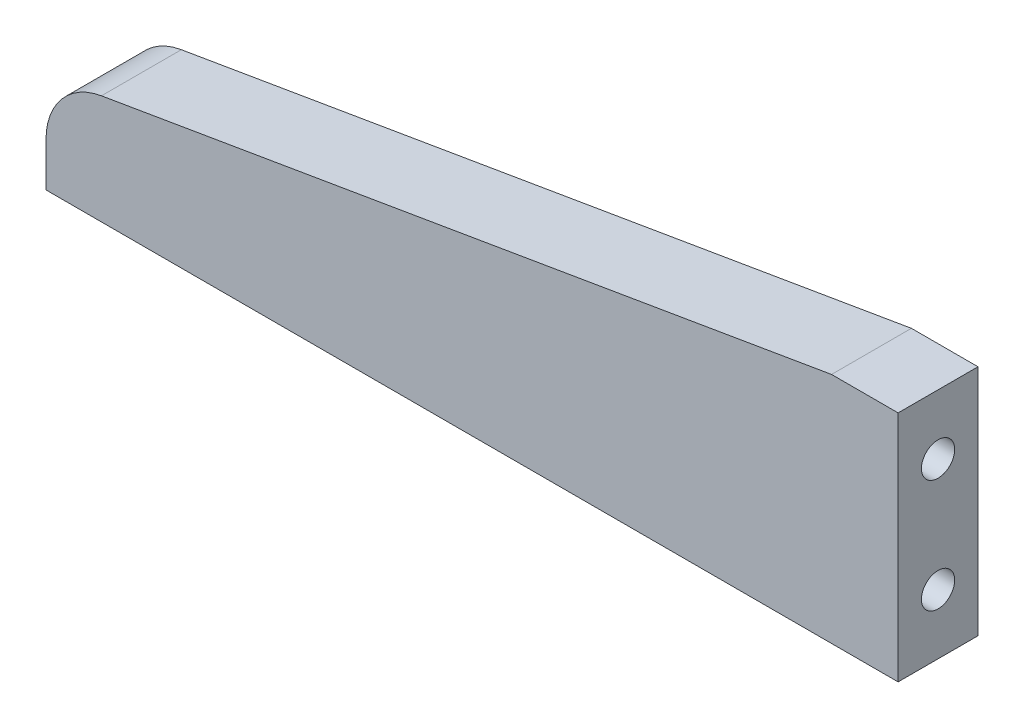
ISO-10303-21;
HEADER;
FILE_DESCRIPTION(('STEP AP214'),'2;1');
FILE_NAME('part.step','',(''),(''),'','','');
FILE_SCHEMA(('AUTOMOTIVE_DESIGN { 1 0 10303 214 1 1 1 1 }'));
ENDSEC;
DATA;
#1=APPLICATION_CONTEXT('core data for automotive mechanical design processes');
#2=APPLICATION_PROTOCOL_DEFINITION('international standard','automotive_design',2000,#1);
#3=PRODUCT_CONTEXT('',#1,'mechanical');
#4=PRODUCT('Part','Part','',(#3));
#5=PRODUCT_RELATED_PRODUCT_CATEGORY('part','',(#4));
#6=PRODUCT_DEFINITION_FORMATION('','',#4);
#7=PRODUCT_DEFINITION_CONTEXT('part definition',#1,'design');
#8=PRODUCT_DEFINITION('design','',#6,#7);
#9=PRODUCT_DEFINITION_SHAPE('','',#8);
#10=(LENGTH_UNIT() NAMED_UNIT(*) SI_UNIT(.MILLI.,.METRE.));
#11=(NAMED_UNIT(*) PLANE_ANGLE_UNIT() SI_UNIT($,.RADIAN.));
#12=(NAMED_UNIT(*) SI_UNIT($,.STERADIAN.) SOLID_ANGLE_UNIT());
#13=UNCERTAINTY_MEASURE_WITH_UNIT(LENGTH_MEASURE(1.E-05),#10,'distance_accuracy_value','');
#14=(GEOMETRIC_REPRESENTATION_CONTEXT(3) GLOBAL_UNCERTAINTY_ASSIGNED_CONTEXT((#13)) GLOBAL_UNIT_ASSIGNED_CONTEXT((#10,
#11,#12)) REPRESENTATION_CONTEXT('',''));
#15=CARTESIAN_POINT('',(0.,0.,0.));
#16=DIRECTION('',(0.,0.,1.));
#17=DIRECTION('',(1.,0.,0.));
#18=AXIS2_PLACEMENT_3D('',#15,#16,#17);
#19=CARTESIAN_POINT('',(-12.,-8.,12.));
#20=DIRECTION('',(-1.,0.,0.));
#21=DIRECTION('',(0.,0.,1.));
#22=AXIS2_PLACEMENT_3D('',#19,#20,#21);
#23=PLANE('',#22);
#24=CARTESIAN_POINT('',(-12.,1.,6.));
#25=DIRECTION('',(1.,0.,0.));
#26=DIRECTION('',(0.,0.,-1.));
#27=AXIS2_PLACEMENT_3D('',#24,#25,#26);
#28=CIRCLE('',#27,2.5);
#29=CARTESIAN_POINT('',(-12.,1.,3.5));
#30=VERTEX_POINT('',#29);
#31=EDGE_CURVE('E100',#30,#30,#28,.T.);
#32=ORIENTED_EDGE('',*,*,#31,.F.);
#33=EDGE_LOOP('',(#32));
#34=FACE_BOUND('',#33,.T.);
#35=CARTESIAN_POINT('',(-12.,18.,6.));
#36=DIRECTION('',(1.,0.,0.));
#37=DIRECTION('',(0.,0.,-1.));
#38=AXIS2_PLACEMENT_3D('',#35,#36,#37);
#39=CIRCLE('',#38,2.5);
#40=CARTESIAN_POINT('',(-12.,18.,3.5));
#41=VERTEX_POINT('',#40);
#42=EDGE_CURVE('E106',#41,#41,#39,.T.);
#43=ORIENTED_EDGE('',*,*,#42,.F.);
#44=EDGE_LOOP('',(#43));
#45=FACE_BOUND('',#44,.T.);
#46=DIRECTION('',(0.,1.,0.));
#47=VECTOR('',#46,1.);
#48=CARTESIAN_POINT('',(-12.,-8.,0.));
#49=LINE('',#48,#47);
#50=CARTESIAN_POINT('',(-12.,-8.,0.));
#51=VERTEX_POINT('',#50);
#52=CARTESIAN_POINT('',(-12.,27.,0.));
#53=VERTEX_POINT('',#52);
#54=EDGE_CURVE('E112',#51,#53,#49,.T.);
#55=ORIENTED_EDGE('',*,*,#54,.T.);
#56=DIRECTION('',(0.,0.,-1.));
#57=VECTOR('',#56,1.);
#58=CARTESIAN_POINT('',(-12.,27.,12.));
#59=LINE('',#58,#57);
#60=CARTESIAN_POINT('',(-12.,27.,12.));
#61=VERTEX_POINT('',#60);
#62=EDGE_CURVE('E143',#61,#53,#59,.T.);
#63=ORIENTED_EDGE('',*,*,#62,.F.);
#64=DIRECTION('',(0.,1.,0.));
#65=VECTOR('',#64,1.);
#66=CARTESIAN_POINT('',(-12.,-8.,12.));
#67=LINE('',#66,#65);
#68=CARTESIAN_POINT('',(-12.,-8.,12.));
#69=VERTEX_POINT('',#68);
#70=EDGE_CURVE('E113',#69,#61,#67,.T.);
#71=ORIENTED_EDGE('',*,*,#70,.F.);
#72=DIRECTION('',(0.,0.,-1.));
#73=VECTOR('',#72,1.);
#74=CARTESIAN_POINT('',(-12.,-8.,12.));
#75=LINE('',#74,#73);
#76=EDGE_CURVE('E125',#69,#51,#75,.T.);
#77=ORIENTED_EDGE('',*,*,#76,.T.);
#78=EDGE_LOOP('',(#55,#63,#71,#77));
#79=FACE_BOUND('',#78,.T.);
#80=ADVANCED_FACE('F16',(#34,#45,#79),#23,.F.);
#81=CARTESIAN_POINT('',(-12.,27.,12.));
#82=DIRECTION('',(0.,-1.,0.));
#83=DIRECTION('',(1.,0.,0.));
#84=AXIS2_PLACEMENT_3D('',#81,#82,#83);
#85=PLANE('',#84);
#86=DIRECTION('',(-1.,0.,0.));
#87=VECTOR('',#86,1.);
#88=CARTESIAN_POINT('',(-12.,27.,0.));
#89=LINE('',#88,#87);
#90=CARTESIAN_POINT('',(-22.,27.,0.));
#91=VERTEX_POINT('',#90);
#92=EDGE_CURVE('E128',#53,#91,#89,.T.);
#93=ORIENTED_EDGE('',*,*,#92,.T.);
#94=DIRECTION('',(0.,0.,-1.));
#95=VECTOR('',#94,1.);
#96=CARTESIAN_POINT('',(-22.,27.,12.));
#97=LINE('',#96,#95);
#98=CARTESIAN_POINT('',(-22.,27.,12.));
#99=VERTEX_POINT('',#98);
#100=EDGE_CURVE('E140',#99,#91,#97,.T.);
#101=ORIENTED_EDGE('',*,*,#100,.F.);
#102=DIRECTION('',(-1.,0.,0.));
#103=VECTOR('',#102,1.);
#104=CARTESIAN_POINT('',(-12.,27.,12.));
#105=LINE('',#104,#103);
#106=EDGE_CURVE('E116',#61,#99,#105,.T.);
#107=ORIENTED_EDGE('',*,*,#106,.F.);
#108=ORIENTED_EDGE('',*,*,#62,.T.);
#109=EDGE_LOOP('',(#93,#101,#107,#108));
#110=FACE_BOUND('',#109,.T.);
#111=ADVANCED_FACE('F182',(#110),#85,.F.);
#112=CARTESIAN_POINT('',(-140.,7.,12.));
#113=DIRECTION('',(0.167108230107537,-0.985938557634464,0.));
#114=DIRECTION('',(0.985938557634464,0.167108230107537,0.));
#115=AXIS2_PLACEMENT_3D('',#112,#113,#114);
#116=PLANE('',#115);
#117=DIRECTION('',(-0.985938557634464,-0.167108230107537,0.));
#118=VECTOR('',#117,1.);
#119=CARTESIAN_POINT('',(-140.,7.,0.));
#120=LINE('',#119,#118);
#121=CARTESIAN_POINT('',(-131.671082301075,8.41168096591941,0.));
#122=VERTEX_POINT('',#121);
#123=EDGE_CURVE('E130',#91,#122,#120,.T.);
#124=ORIENTED_EDGE('',*,*,#123,.T.);
#125=DIRECTION('',(0.,0.,-1.));
#126=VECTOR('',#125,1.);
#127=CARTESIAN_POINT('',(-131.671082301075,8.41168096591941,12.));
#128=LINE('',#127,#126);
#129=CARTESIAN_POINT('',(-131.671082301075,8.41168096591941,12.));
#130=VERTEX_POINT('',#129);
#131=EDGE_CURVE('E24',#122,#130,#128,.F.);
#132=ORIENTED_EDGE('',*,*,#131,.T.);
#133=DIRECTION('',(-0.985938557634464,-0.167108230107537,0.));
#134=VECTOR('',#133,1.);
#135=CARTESIAN_POINT('',(-140.,7.,12.));
#136=LINE('',#135,#134);
#137=EDGE_CURVE('E119',#99,#130,#136,.T.);
#138=ORIENTED_EDGE('',*,*,#137,.F.);
#139=ORIENTED_EDGE('',*,*,#100,.T.);
#140=EDGE_LOOP('',(#124,#132,#138,#139));
#141=FACE_BOUND('',#140,.T.);
#142=ADVANCED_FACE('F188',(#141),#116,.F.);
#143=CARTESIAN_POINT('',(-140.,-8.,12.));
#144=DIRECTION('',(1.,0.,0.));
#145=DIRECTION('',(0.,0.,-1.));
#146=AXIS2_PLACEMENT_3D('',#143,#144,#145);
#147=PLANE('',#146);
#148=DIRECTION('',(0.,-1.,0.));
#149=VECTOR('',#148,1.);
#150=CARTESIAN_POINT('',(-140.,-8.,12.));
#151=LINE('',#150,#149);
#152=CARTESIAN_POINT('',(-140.,-1.44770461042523,12.));
#153=VERTEX_POINT('',#152);
#154=CARTESIAN_POINT('',(-140.,-8.,12.));
#155=VERTEX_POINT('',#154);
#156=EDGE_CURVE('E121',#153,#155,#151,.T.);
#157=ORIENTED_EDGE('',*,*,#156,.F.);
#158=DIRECTION('',(0.,0.,-1.));
#159=VECTOR('',#158,1.);
#160=CARTESIAN_POINT('',(-140.,-1.44770461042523,12.));
#161=LINE('',#160,#159);
#162=CARTESIAN_POINT('',(-140.,-1.44770461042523,0.));
#163=VERTEX_POINT('',#162);
#164=EDGE_CURVE('E146',#153,#163,#161,.T.);
#165=ORIENTED_EDGE('',*,*,#164,.T.);
#166=DIRECTION('',(0.,-1.,0.));
#167=VECTOR('',#166,1.);
#168=CARTESIAN_POINT('',(-140.,-8.,0.));
#169=LINE('',#168,#167);
#170=CARTESIAN_POINT('',(-140.,-8.,0.));
#171=VERTEX_POINT('',#170);
#172=EDGE_CURVE('E132',#163,#171,#169,.T.);
#173=ORIENTED_EDGE('',*,*,#172,.T.);
#174=DIRECTION('',(0.,0.,-1.));
#175=VECTOR('',#174,1.);
#176=CARTESIAN_POINT('',(-140.,-8.,12.));
#177=LINE('',#176,#175);
#178=EDGE_CURVE('E137',#155,#171,#177,.T.);
#179=ORIENTED_EDGE('',*,*,#178,.F.);
#180=EDGE_LOOP('',(#157,#165,#173,#179));
#181=FACE_BOUND('',#180,.T.);
#182=ADVANCED_FACE('F152',(#181),#147,.F.);
#183=CARTESIAN_POINT('',(-12.,-8.,12.));
#184=DIRECTION('',(0.,1.,0.));
#185=DIRECTION('',(-1.,0.,0.));
#186=AXIS2_PLACEMENT_3D('',#183,#184,#185);
#187=PLANE('',#186);
#188=CARTESIAN_POINT('',(-40.,-8.,6.));
#189=DIRECTION('',(0.,-1.,0.));
#190=DIRECTION('',(0.,0.,-1.));
#191=AXIS2_PLACEMENT_3D('',#188,#189,#190);
#192=CIRCLE('',#191,2.5);
#193=CARTESIAN_POINT('',(-40.,-8.,3.5));
#194=VERTEX_POINT('',#193);
#195=EDGE_CURVE('E90',#194,#194,#192,.T.);
#196=ORIENTED_EDGE('',*,*,#195,.F.);
#197=EDGE_LOOP('',(#196));
#198=FACE_BOUND('',#197,.T.);
#199=CARTESIAN_POINT('',(-115.,-8.,6.));
#200=DIRECTION('',(0.,-1.,0.));
#201=DIRECTION('',(0.,0.,-1.));
#202=AXIS2_PLACEMENT_3D('',#199,#200,#201);
#203=CIRCLE('',#202,2.5);
#204=CARTESIAN_POINT('',(-115.,-8.,3.5));
#205=VERTEX_POINT('',#204);
#206=EDGE_CURVE('E89',#205,#205,#203,.T.);
#207=ORIENTED_EDGE('',*,*,#206,.F.);
#208=EDGE_LOOP('',(#207));
#209=FACE_BOUND('',#208,.T.);
#210=DIRECTION('',(1.,0.,0.));
#211=VECTOR('',#210,1.);
#212=CARTESIAN_POINT('',(-12.,-8.,0.));
#213=LINE('',#212,#211);
#214=EDGE_CURVE('E117',#171,#51,#213,.T.);
#215=ORIENTED_EDGE('',*,*,#214,.T.);
#216=ORIENTED_EDGE('',*,*,#76,.F.);
#217=DIRECTION('',(1.,0.,0.));
#218=VECTOR('',#217,1.);
#219=CARTESIAN_POINT('',(-12.,-8.,12.));
#220=LINE('',#219,#218);
#221=EDGE_CURVE('E123',#155,#69,#220,.T.);
#222=ORIENTED_EDGE('',*,*,#221,.F.);
#223=ORIENTED_EDGE('',*,*,#178,.T.);
#224=EDGE_LOOP('',(#215,#216,#222,#223));
#225=FACE_BOUND('',#224,.T.);
#226=ADVANCED_FACE('F161',(#198,#209,#225),#187,.F.);
#227=CARTESIAN_POINT('',(0.,0.,12.));
#228=DIRECTION('',(0.,0.,1.));
#229=DIRECTION('',(1.,0.,0.));
#230=AXIS2_PLACEMENT_3D('',#227,#228,#229);
#231=PLANE('',#230);
#232=ORIENTED_EDGE('',*,*,#137,.T.);
#233=CARTESIAN_POINT('',(-130.,-1.44770461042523,12.));
#234=DIRECTION('',(0.,0.,1.));
#235=DIRECTION('',(1.,0.,0.));
#236=AXIS2_PLACEMENT_3D('',#233,#234,#235);
#237=CIRCLE('',#236,10.);
#238=EDGE_CURVE('E11',#130,#153,#237,.T.);
#239=ORIENTED_EDGE('',*,*,#238,.T.);
#240=ORIENTED_EDGE('',*,*,#156,.T.);
#241=ORIENTED_EDGE('',*,*,#221,.T.);
#242=ORIENTED_EDGE('',*,*,#70,.T.);
#243=ORIENTED_EDGE('',*,*,#106,.T.);
#244=EDGE_LOOP('',(#232,#239,#240,#241,#242,#243));
#245=FACE_BOUND('',#244,.T.);
#246=ADVANCED_FACE('F167',(#245),#231,.T.);
#247=CARTESIAN_POINT('',(0.,0.,0.));
#248=DIRECTION('',(0.,0.,1.));
#249=DIRECTION('',(1.,0.,0.));
#250=AXIS2_PLACEMENT_3D('',#247,#248,#249);
#251=PLANE('',#250);
#252=ORIENTED_EDGE('',*,*,#172,.F.);
#253=CARTESIAN_POINT('',(-130.,-1.44770461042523,0.));
#254=DIRECTION('',(0.,0.,1.));
#255=DIRECTION('',(1.,0.,0.));
#256=AXIS2_PLACEMENT_3D('',#253,#254,#255);
#257=CIRCLE('',#256,10.);
#258=EDGE_CURVE('E38',#163,#122,#257,.F.);
#259=ORIENTED_EDGE('',*,*,#258,.T.);
#260=ORIENTED_EDGE('',*,*,#123,.F.);
#261=ORIENTED_EDGE('',*,*,#92,.F.);
#262=ORIENTED_EDGE('',*,*,#54,.F.);
#263=ORIENTED_EDGE('',*,*,#214,.F.);
#264=EDGE_LOOP('',(#252,#259,#260,#261,#262,#263));
#265=FACE_BOUND('',#264,.T.);
#266=ADVANCED_FACE('F157',(#265),#251,.F.);
#267=CARTESIAN_POINT('',(-130.,-1.44770461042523,12.));
#268=DIRECTION('',(0.,0.,-1.));
#269=DIRECTION('',(-1.,0.,0.));
#270=AXIS2_PLACEMENT_3D('',#267,#268,#269);
#271=CYLINDRICAL_SURFACE('',#270,10.);
#272=ORIENTED_EDGE('',*,*,#238,.F.);
#273=ORIENTED_EDGE('',*,*,#131,.F.);
#274=ORIENTED_EDGE('',*,*,#258,.F.);
#275=ORIENTED_EDGE('',*,*,#164,.F.);
#276=EDGE_LOOP('',(#272,#273,#274,#275));
#277=FACE_BOUND('',#276,.T.);
#278=ADVANCED_FACE('F18',(#277),#271,.T.);
#279=CARTESIAN_POINT('',(-29.,18.,6.));
#280=DIRECTION('',(1.,0.,0.));
#281=DIRECTION('',(0.,0.,-1.));
#282=AXIS2_PLACEMENT_3D('',#279,#280,#281);
#283=CONICAL_SURFACE('',#282,2.5,1.02974425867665);
#284=CARTESIAN_POINT('',(-30.5021515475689,18.,6.));
#285=VERTEX_POINT('',#284);
#286=VERTEX_LOOP('',#285);
#287=FACE_BOUND('',#286,.T.);
#288=CARTESIAN_POINT('',(-29.,18.,6.));
#289=DIRECTION('',(1.,0.,0.));
#290=DIRECTION('',(0.,0.,-1.));
#291=AXIS2_PLACEMENT_3D('',#288,#289,#290);
#292=CIRCLE('',#291,2.5);
#293=CARTESIAN_POINT('',(-29.,18.,3.5));
#294=VERTEX_POINT('',#293);
#295=EDGE_CURVE('E109',#294,#294,#292,.T.);
#296=ORIENTED_EDGE('',*,*,#295,.T.);
#297=EDGE_LOOP('',(#296));
#298=FACE_BOUND('',#297,.T.);
#299=ADVANCED_FACE('F170',(#287,#298),#283,.F.);
#300=CARTESIAN_POINT('',(-12.,18.,6.));
#301=DIRECTION('',(1.,0.,0.));
#302=DIRECTION('',(0.,0.,-1.));
#303=AXIS2_PLACEMENT_3D('',#300,#301,#302);
#304=CYLINDRICAL_SURFACE('',#303,2.5);
#305=ORIENTED_EDGE('',*,*,#295,.F.);
#306=EDGE_LOOP('',(#305));
#307=FACE_BOUND('',#306,.T.);
#308=ORIENTED_EDGE('',*,*,#42,.T.);
#309=EDGE_LOOP('',(#308));
#310=FACE_BOUND('',#309,.T.);
#311=ADVANCED_FACE('F177',(#307,#310),#304,.F.);
#312=CARTESIAN_POINT('',(-29.,1.,6.));
#313=DIRECTION('',(1.,0.,0.));
#314=DIRECTION('',(0.,0.,-1.));
#315=AXIS2_PLACEMENT_3D('',#312,#313,#314);
#316=CONICAL_SURFACE('',#315,2.5,1.02974425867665);
#317=CARTESIAN_POINT('',(-30.5021515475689,1.,6.));
#318=VERTEX_POINT('',#317);
#319=VERTEX_LOOP('',#318);
#320=FACE_BOUND('',#319,.T.);
#321=CARTESIAN_POINT('',(-29.,1.,6.));
#322=DIRECTION('',(1.,0.,0.));
#323=DIRECTION('',(0.,0.,-1.));
#324=AXIS2_PLACEMENT_3D('',#321,#322,#323);
#325=CIRCLE('',#324,2.5);
#326=CARTESIAN_POINT('',(-29.,1.,3.5));
#327=VERTEX_POINT('',#326);
#328=EDGE_CURVE('E103',#327,#327,#325,.T.);
#329=ORIENTED_EDGE('',*,*,#328,.T.);
#330=EDGE_LOOP('',(#329));
#331=FACE_BOUND('',#330,.T.);
#332=ADVANCED_FACE('F205',(#320,#331),#316,.F.);
#333=CARTESIAN_POINT('',(-12.,1.,6.));
#334=DIRECTION('',(1.,0.,0.));
#335=DIRECTION('',(0.,0.,-1.));
#336=AXIS2_PLACEMENT_3D('',#333,#334,#335);
#337=CYLINDRICAL_SURFACE('',#336,2.5);
#338=ORIENTED_EDGE('',*,*,#328,.F.);
#339=EDGE_LOOP('',(#338));
#340=FACE_BOUND('',#339,.T.);
#341=ORIENTED_EDGE('',*,*,#31,.T.);
#342=EDGE_LOOP('',(#341));
#343=FACE_BOUND('',#342,.T.);
#344=ADVANCED_FACE('F209',(#340,#343),#337,.F.);
#345=CARTESIAN_POINT('',(-115.,9.,6.));
#346=DIRECTION('',(0.,-1.,0.));
#347=DIRECTION('',(0.,0.,-1.));
#348=AXIS2_PLACEMENT_3D('',#345,#346,#347);
#349=CONICAL_SURFACE('',#348,2.5,1.02974425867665);
#350=CARTESIAN_POINT('',(-115.,10.5021515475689,6.));
#351=VERTEX_POINT('',#350);
#352=VERTEX_LOOP('',#351);
#353=FACE_BOUND('',#352,.T.);
#354=CARTESIAN_POINT('',(-115.,9.,6.));
#355=DIRECTION('',(0.,-1.,0.));
#356=DIRECTION('',(0.,0.,-1.));
#357=AXIS2_PLACEMENT_3D('',#354,#355,#356);
#358=CIRCLE('',#357,2.5);
#359=CARTESIAN_POINT('',(-115.,9.,3.5));
#360=VERTEX_POINT('',#359);
#361=EDGE_CURVE('E93',#360,#360,#358,.T.);
#362=ORIENTED_EDGE('',*,*,#361,.T.);
#363=EDGE_LOOP('',(#362));
#364=FACE_BOUND('',#363,.T.);
#365=ADVANCED_FACE('F213',(#353,#364),#349,.F.);
#366=CARTESIAN_POINT('',(-115.,-8.,6.));
#367=DIRECTION('',(0.,-1.,0.));
#368=DIRECTION('',(0.,0.,-1.));
#369=AXIS2_PLACEMENT_3D('',#366,#367,#368);
#370=CYLINDRICAL_SURFACE('',#369,2.5);
#371=ORIENTED_EDGE('',*,*,#361,.F.);
#372=EDGE_LOOP('',(#371));
#373=FACE_BOUND('',#372,.T.);
#374=ORIENTED_EDGE('',*,*,#206,.T.);
#375=EDGE_LOOP('',(#374));
#376=FACE_BOUND('',#375,.T.);
#377=ADVANCED_FACE('F83',(#373,#376),#370,.F.);
#378=CARTESIAN_POINT('',(-40.,9.,6.));
#379=DIRECTION('',(0.,-1.,0.));
#380=DIRECTION('',(0.,0.,-1.));
#381=AXIS2_PLACEMENT_3D('',#378,#379,#380);
#382=CONICAL_SURFACE('',#381,2.5,1.02974425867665);
#383=CARTESIAN_POINT('',(-40.,10.5021515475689,6.));
#384=VERTEX_POINT('',#383);
#385=VERTEX_LOOP('',#384);
#386=FACE_BOUND('',#385,.T.);
#387=CARTESIAN_POINT('',(-40.,9.,6.));
#388=DIRECTION('',(0.,-1.,0.));
#389=DIRECTION('',(0.,0.,-1.));
#390=AXIS2_PLACEMENT_3D('',#387,#388,#389);
#391=CIRCLE('',#390,2.5);
#392=CARTESIAN_POINT('',(-40.,9.,3.5));
#393=VERTEX_POINT('',#392);
#394=EDGE_CURVE('E87',#393,#393,#391,.T.);
#395=ORIENTED_EDGE('',*,*,#394,.T.);
#396=EDGE_LOOP('',(#395));
#397=FACE_BOUND('',#396,.T.);
#398=ADVANCED_FACE('F79',(#386,#397),#382,.F.);
#399=CARTESIAN_POINT('',(-40.,-8.,6.));
#400=DIRECTION('',(0.,-1.,0.));
#401=DIRECTION('',(0.,0.,-1.));
#402=AXIS2_PLACEMENT_3D('',#399,#400,#401);
#403=CYLINDRICAL_SURFACE('',#402,2.5);
#404=ORIENTED_EDGE('',*,*,#394,.F.);
#405=EDGE_LOOP('',(#404));
#406=FACE_BOUND('',#405,.T.);
#407=ORIENTED_EDGE('',*,*,#195,.T.);
#408=EDGE_LOOP('',(#407));
#409=FACE_BOUND('',#408,.T.);
#410=ADVANCED_FACE('F82',(#406,#409),#403,.F.);
#411=CLOSED_SHELL('',(#80,#111,#142,#182,#226,#246,#266,#278,#299,#311,#332,#344,#365,#377,#398,#410));
#412=MANIFOLD_SOLID_BREP('B1',#411);
#413=ADVANCED_BREP_SHAPE_REPRESENTATION('',(#18,#412),#14);
#414=SHAPE_DEFINITION_REPRESENTATION(#9,#413);
ENDSEC;
END-ISO-10303-21;
